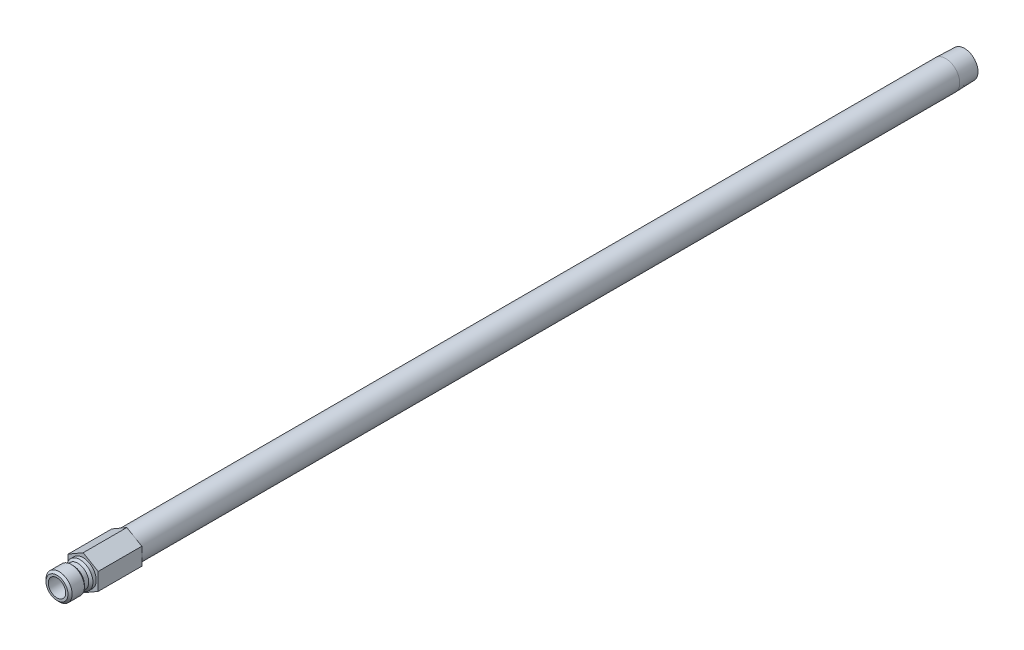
ISO-10303-21;
HEADER;
FILE_DESCRIPTION(('STEP AP214'),'2;1');
FILE_NAME('part.step','',(''),(''),'','','');
FILE_SCHEMA(('AUTOMOTIVE_DESIGN { 1 0 10303 214 1 1 1 1 }'));
ENDSEC;
DATA;
#1=APPLICATION_CONTEXT('core data for automotive mechanical design processes');
#2=APPLICATION_PROTOCOL_DEFINITION('international standard','automotive_design',2000,#1);
#3=PRODUCT_CONTEXT('',#1,'mechanical');
#4=PRODUCT('Part','Part','',(#3));
#5=PRODUCT_RELATED_PRODUCT_CATEGORY('part','',(#4));
#6=PRODUCT_DEFINITION_FORMATION('','',#4);
#7=PRODUCT_DEFINITION_CONTEXT('part definition',#1,'design');
#8=PRODUCT_DEFINITION('design','',#6,#7);
#9=PRODUCT_DEFINITION_SHAPE('','',#8);
#10=(LENGTH_UNIT() NAMED_UNIT(*) SI_UNIT(.MILLI.,.METRE.));
#11=(NAMED_UNIT(*) PLANE_ANGLE_UNIT() SI_UNIT($,.RADIAN.));
#12=(NAMED_UNIT(*) SI_UNIT($,.STERADIAN.) SOLID_ANGLE_UNIT());
#13=UNCERTAINTY_MEASURE_WITH_UNIT(LENGTH_MEASURE(1.E-05),#10,'distance_accuracy_value','');
#14=(GEOMETRIC_REPRESENTATION_CONTEXT(3) GLOBAL_UNCERTAINTY_ASSIGNED_CONTEXT((#13)) GLOBAL_UNIT_ASSIGNED_CONTEXT((#10,
#11,#12)) REPRESENTATION_CONTEXT('',''));
#15=CARTESIAN_POINT('',(0.,0.,0.));
#16=DIRECTION('',(0.,0.,1.));
#17=DIRECTION('',(1.,0.,0.));
#18=AXIS2_PLACEMENT_3D('',#15,#16,#17);
#19=CARTESIAN_POINT('',(0.,4.7625,0.));
#20=DIRECTION('',(0.,0.,1.));
#21=DIRECTION('',(0.,-1.,0.));
#22=AXIS2_PLACEMENT_3D('',#19,#20,#21);
#23=PLANE('',#22);
#24=CARTESIAN_POINT('',(0.,0.,0.));
#25=DIRECTION('',(0.,0.,-1.));
#26=DIRECTION('',(0.,1.,0.));
#27=AXIS2_PLACEMENT_3D('',#24,#25,#26);
#28=CIRCLE('',#27,4.7625);
#29=CARTESIAN_POINT('',(0.,4.7625,0.));
#30=VERTEX_POINT('',#29);
#31=EDGE_CURVE('E166',#30,#30,#28,.T.);
#32=ORIENTED_EDGE('',*,*,#31,.T.);
#33=EDGE_LOOP('',(#32));
#34=FACE_BOUND('',#33,.T.);
#35=DIRECTION('',(-0.866025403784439,-0.5,0.));
#36=VECTOR('',#35,1.);
#37=CARTESIAN_POINT('',(0.,6.3058196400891,0.));
#38=LINE('',#37,#36);
#39=CARTESIAN_POINT('',(0.,6.3058196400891,0.));
#40=VERTEX_POINT('',#39);
#41=CARTESIAN_POINT('',(-5.461,3.15290982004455,0.));
#42=VERTEX_POINT('',#41);
#43=EDGE_CURVE('E122',#40,#42,#38,.T.);
#44=ORIENTED_EDGE('',*,*,#43,.T.);
#45=DIRECTION('',(0.,-1.,0.));
#46=VECTOR('',#45,1.);
#47=CARTESIAN_POINT('',(-5.461,3.15290982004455,0.));
#48=LINE('',#47,#46);
#49=CARTESIAN_POINT('',(-5.461,-3.15290982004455,0.));
#50=VERTEX_POINT('',#49);
#51=EDGE_CURVE('E125',#42,#50,#48,.T.);
#52=ORIENTED_EDGE('',*,*,#51,.T.);
#53=DIRECTION('',(0.866025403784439,-0.5,0.));
#54=VECTOR('',#53,1.);
#55=CARTESIAN_POINT('',(-5.461,-3.15290982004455,0.));
#56=LINE('',#55,#54);
#57=CARTESIAN_POINT('',(0.,-6.30581964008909,0.));
#58=VERTEX_POINT('',#57);
#59=EDGE_CURVE('E129',#50,#58,#56,.T.);
#60=ORIENTED_EDGE('',*,*,#59,.T.);
#61=DIRECTION('',(0.866025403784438,0.5,0.));
#62=VECTOR('',#61,1.);
#63=CARTESIAN_POINT('',(0.,-6.30581964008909,0.));
#64=LINE('',#63,#62);
#65=CARTESIAN_POINT('',(5.461,-3.15290982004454,0.));
#66=VERTEX_POINT('',#65);
#67=EDGE_CURVE('E132',#58,#66,#64,.T.);
#68=ORIENTED_EDGE('',*,*,#67,.T.);
#69=DIRECTION('',(0.,1.,0.));
#70=VECTOR('',#69,1.);
#71=CARTESIAN_POINT('',(5.461,-3.15290982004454,0.));
#72=LINE('',#71,#70);
#73=CARTESIAN_POINT('',(5.461,3.15290982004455,0.));
#74=VERTEX_POINT('',#73);
#75=EDGE_CURVE('E99',#66,#74,#72,.T.);
#76=ORIENTED_EDGE('',*,*,#75,.T.);
#77=DIRECTION('',(-0.866025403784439,0.5,0.));
#78=VECTOR('',#77,1.);
#79=CARTESIAN_POINT('',(5.461,3.15290982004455,0.));
#80=LINE('',#79,#78);
#81=EDGE_CURVE('E135',#74,#40,#80,.T.);
#82=ORIENTED_EDGE('',*,*,#81,.T.);
#83=EDGE_LOOP('',(#44,#52,#60,#68,#76,#82));
#84=FACE_BOUND('',#83,.T.);
#85=ADVANCED_FACE('F33',(#34,#84),#23,.T.);
#86=CARTESIAN_POINT('',(0.,0.,0.));
#87=DIRECTION('',(0.,0.,-1.));
#88=DIRECTION('',(0.,1.,0.));
#89=AXIS2_PLACEMENT_3D('',#86,#87,#88);
#90=CYLINDRICAL_SURFACE('',#89,4.7625);
#91=CARTESIAN_POINT('',(0.,0.,1.2065));
#92=DIRECTION('',(0.,0.,-1.));
#93=DIRECTION('',(0.,1.,0.));
#94=AXIS2_PLACEMENT_3D('',#91,#92,#93);
#95=CIRCLE('',#94,4.7625);
#96=CARTESIAN_POINT('',(0.,4.7625,1.2065));
#97=VERTEX_POINT('',#96);
#98=EDGE_CURVE('E163',#97,#97,#95,.T.);
#99=ORIENTED_EDGE('',*,*,#98,.T.);
#100=EDGE_LOOP('',(#99));
#101=FACE_BOUND('',#100,.T.);
#102=ORIENTED_EDGE('',*,*,#31,.F.);
#103=EDGE_LOOP('',(#102));
#104=FACE_BOUND('',#103,.T.);
#105=ADVANCED_FACE('F192',(#101,#104),#90,.T.);
#106=CARTESIAN_POINT('',(0.,0.,1.2065));
#107=DIRECTION('',(0.,0.,-1.));
#108=DIRECTION('',(0.,1.,0.));
#109=AXIS2_PLACEMENT_3D('',#106,#107,#108);
#110=CONICAL_SURFACE('',#109,4.7625,0.785398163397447);
#111=CARTESIAN_POINT('',(0.,0.,1.9685));
#112=DIRECTION('',(0.,0.,-1.));
#113=DIRECTION('',(0.,1.,0.));
#114=AXIS2_PLACEMENT_3D('',#111,#112,#113);
#115=CIRCLE('',#114,4.0005);
#116=CARTESIAN_POINT('',(0.,4.0005,1.9685));
#117=VERTEX_POINT('',#116);
#118=EDGE_CURVE('E160',#117,#117,#115,.T.);
#119=ORIENTED_EDGE('',*,*,#118,.T.);
#120=EDGE_LOOP('',(#119));
#121=FACE_BOUND('',#120,.T.);
#122=ORIENTED_EDGE('',*,*,#98,.F.);
#123=EDGE_LOOP('',(#122));
#124=FACE_BOUND('',#123,.T.);
#125=ADVANCED_FACE('F198',(#121,#124),#110,.T.);
#126=CARTESIAN_POINT('',(0.,0.,0.));
#127=DIRECTION('',(0.,0.,-1.));
#128=DIRECTION('',(0.,1.,0.));
#129=AXIS2_PLACEMENT_3D('',#126,#127,#128);
#130=CYLINDRICAL_SURFACE('',#129,4.0005);
#131=CARTESIAN_POINT('',(0.,0.,3.556));
#132=DIRECTION('',(0.,0.,-1.));
#133=DIRECTION('',(0.,1.,0.));
#134=AXIS2_PLACEMENT_3D('',#131,#132,#133);
#135=CIRCLE('',#134,4.0005);
#136=CARTESIAN_POINT('',(0.,4.0005,3.556));
#137=VERTEX_POINT('',#136);
#138=EDGE_CURVE('E157',#137,#137,#135,.T.);
#139=ORIENTED_EDGE('',*,*,#138,.T.);
#140=EDGE_LOOP('',(#139));
#141=FACE_BOUND('',#140,.T.);
#142=ORIENTED_EDGE('',*,*,#118,.F.);
#143=EDGE_LOOP('',(#142));
#144=FACE_BOUND('',#143,.T.);
#145=ADVANCED_FACE('F258',(#141,#144),#130,.T.);
#146=CARTESIAN_POINT('',(0.,0.,3.556));
#147=DIRECTION('',(0.,0.,1.));
#148=DIRECTION('',(0.,-1.,0.));
#149=AXIS2_PLACEMENT_3D('',#146,#147,#148);
#150=CONICAL_SURFACE('',#149,4.0005,0.785398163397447);
#151=CARTESIAN_POINT('',(0.,0.,4.318));
#152=DIRECTION('',(0.,0.,-1.));
#153=DIRECTION('',(0.,1.,0.));
#154=AXIS2_PLACEMENT_3D('',#151,#152,#153);
#155=CIRCLE('',#154,4.7625);
#156=CARTESIAN_POINT('',(0.,4.7625,4.318));
#157=VERTEX_POINT('',#156);
#158=EDGE_CURVE('E154',#157,#157,#155,.T.);
#159=ORIENTED_EDGE('',*,*,#158,.T.);
#160=EDGE_LOOP('',(#159));
#161=FACE_BOUND('',#160,.T.);
#162=ORIENTED_EDGE('',*,*,#138,.F.);
#163=EDGE_LOOP('',(#162));
#164=FACE_BOUND('',#163,.T.);
#165=ADVANCED_FACE('F254',(#161,#164),#150,.T.);
#166=CARTESIAN_POINT('',(0.,0.,0.));
#167=DIRECTION('',(0.,0.,-1.));
#168=DIRECTION('',(0.,1.,0.));
#169=AXIS2_PLACEMENT_3D('',#166,#167,#168);
#170=CYLINDRICAL_SURFACE('',#169,4.7625);
#171=CARTESIAN_POINT('',(0.,0.,8.763));
#172=DIRECTION('',(0.,0.,-1.));
#173=DIRECTION('',(0.,1.,0.));
#174=AXIS2_PLACEMENT_3D('',#171,#172,#173);
#175=CIRCLE('',#174,4.7625);
#176=CARTESIAN_POINT('',(0.,4.7625,8.763));
#177=VERTEX_POINT('',#176);
#178=EDGE_CURVE('E151',#177,#177,#175,.T.);
#179=ORIENTED_EDGE('',*,*,#178,.T.);
#180=EDGE_LOOP('',(#179));
#181=FACE_BOUND('',#180,.T.);
#182=ORIENTED_EDGE('',*,*,#158,.F.);
#183=EDGE_LOOP('',(#182));
#184=FACE_BOUND('',#183,.T.);
#185=ADVANCED_FACE('F250',(#181,#184),#170,.T.);
#186=CARTESIAN_POINT('',(0.,0.,8.763));
#187=DIRECTION('',(0.,0.,-1.));
#188=DIRECTION('',(0.,1.,0.));
#189=AXIS2_PLACEMENT_3D('',#186,#187,#188);
#190=CONICAL_SURFACE('',#189,4.7625,0.785398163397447);
#191=CARTESIAN_POINT('',(0.,0.,9.525));
#192=DIRECTION('',(0.,0.,-1.));
#193=DIRECTION('',(0.,1.,0.));
#194=AXIS2_PLACEMENT_3D('',#191,#192,#193);
#195=CIRCLE('',#194,4.0005);
#196=CARTESIAN_POINT('',(0.,4.0005,9.525));
#197=VERTEX_POINT('',#196);
#198=EDGE_CURVE('E148',#197,#197,#195,.T.);
#199=ORIENTED_EDGE('',*,*,#198,.T.);
#200=EDGE_LOOP('',(#199));
#201=FACE_BOUND('',#200,.T.);
#202=ORIENTED_EDGE('',*,*,#178,.F.);
#203=EDGE_LOOP('',(#202));
#204=FACE_BOUND('',#203,.T.);
#205=ADVANCED_FACE('F246',(#201,#204),#190,.T.);
#206=CARTESIAN_POINT('',(0.,3.175,9.525));
#207=DIRECTION('',(0.,0.,1.));
#208=DIRECTION('',(0.,-1.,0.));
#209=AXIS2_PLACEMENT_3D('',#206,#207,#208);
#210=PLANE('',#209);
#211=CARTESIAN_POINT('',(0.,0.,9.525));
#212=DIRECTION('',(0.,0.,-1.));
#213=DIRECTION('',(0.,1.,0.));
#214=AXIS2_PLACEMENT_3D('',#211,#212,#213);
#215=CIRCLE('',#214,3.175);
#216=CARTESIAN_POINT('',(0.,3.175,9.525));
#217=VERTEX_POINT('',#216);
#218=EDGE_CURVE('E145',#217,#217,#215,.T.);
#219=ORIENTED_EDGE('',*,*,#218,.T.);
#220=EDGE_LOOP('',(#219));
#221=FACE_BOUND('',#220,.T.);
#222=ORIENTED_EDGE('',*,*,#198,.F.);
#223=EDGE_LOOP('',(#222));
#224=FACE_BOUND('',#223,.T.);
#225=ADVANCED_FACE('F242',(#221,#224),#210,.T.);
#226=CARTESIAN_POINT('',(0.,0.,0.));
#227=DIRECTION('',(0.,0.,-1.));
#228=DIRECTION('',(0.,1.,0.));
#229=AXIS2_PLACEMENT_3D('',#226,#227,#228);
#230=CYLINDRICAL_SURFACE('',#229,3.175);
#231=CARTESIAN_POINT('',(0.,0.,0.));
#232=DIRECTION('',(0.,0.,1.));
#233=DIRECTION('',(1.,0.,0.));
#234=AXIS2_PLACEMENT_3D('',#231,#232,#233);
#235=CIRCLE('',#234,3.175);
#236=CARTESIAN_POINT('',(3.175,0.,0.));
#237=VERTEX_POINT('',#236);
#238=EDGE_CURVE('E11',#237,#237,#235,.T.);
#239=ORIENTED_EDGE('',*,*,#238,.F.);
#240=EDGE_LOOP('',(#239));
#241=FACE_BOUND('',#240,.T.);
#242=ORIENTED_EDGE('',*,*,#218,.F.);
#243=EDGE_LOOP('',(#242));
#244=FACE_BOUND('',#243,.T.);
#245=ADVANCED_FACE('F226',(#241,#244),#230,.F.);
#246=CARTESIAN_POINT('',(-5.461,3.15290982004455,0.));
#247=DIRECTION('',(0.,0.,1.));
#248=DIRECTION('',(1.,0.,0.));
#249=AXIS2_PLACEMENT_3D('',#246,#247,#248);
#250=PLANE('',#249);
#251=ORIENTED_EDGE('',*,*,#238,.T.);
#252=EDGE_LOOP('',(#251));
#253=FACE_BOUND('',#252,.T.);
#254=CARTESIAN_POINT('',(0.,0.,0.));
#255=DIRECTION('',(0.,0.,1.));
#256=DIRECTION('',(1.,0.,0.));
#257=AXIS2_PLACEMENT_3D('',#254,#255,#256);
#258=CIRCLE('',#257,2.38124999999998);
#259=CARTESIAN_POINT('',(2.38124999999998,0.,0.));
#260=VERTEX_POINT('',#259);
#261=EDGE_CURVE('E126',#260,#260,#258,.T.);
#262=ORIENTED_EDGE('',*,*,#261,.F.);
#263=EDGE_LOOP('',(#262));
#264=FACE_BOUND('',#263,.T.);
#265=ADVANCED_FACE('F222',(#253,#264),#250,.T.);
#266=CARTESIAN_POINT('',(0.,6.3058196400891,-15.875));
#267=DIRECTION('',(-0.5,0.866025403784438,0.));
#268=DIRECTION('',(-0.866025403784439,-0.5,0.));
#269=AXIS2_PLACEMENT_3D('',#266,#267,#268);
#270=PLANE('',#269);
#271=ORIENTED_EDGE('',*,*,#43,.F.);
#272=DIRECTION('',(0.,0.,1.));
#273=VECTOR('',#272,1.);
#274=CARTESIAN_POINT('',(0.,6.3058196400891,-15.875));
#275=LINE('',#274,#273);
#276=CARTESIAN_POINT('',(0.,6.3058196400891,-15.875));
#277=VERTEX_POINT('',#276);
#278=EDGE_CURVE('E51',#277,#40,#275,.T.);
#279=ORIENTED_EDGE('',*,*,#278,.F.);
#280=DIRECTION('',(-0.866025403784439,-0.5,0.));
#281=VECTOR('',#280,1.);
#282=CARTESIAN_POINT('',(0.,6.3058196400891,-15.875));
#283=LINE('',#282,#281);
#284=CARTESIAN_POINT('',(-5.461,3.15290982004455,-15.875));
#285=VERTEX_POINT('',#284);
#286=EDGE_CURVE('E138',#277,#285,#283,.T.);
#287=ORIENTED_EDGE('',*,*,#286,.T.);
#288=DIRECTION('',(0.,0.,1.));
#289=VECTOR('',#288,1.);
#290=CARTESIAN_POINT('',(-5.461,3.15290982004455,-15.875));
#291=LINE('',#290,#289);
#292=EDGE_CURVE('E86',#285,#42,#291,.T.);
#293=ORIENTED_EDGE('',*,*,#292,.T.);
#294=EDGE_LOOP('',(#271,#279,#287,#293));
#295=FACE_BOUND('',#294,.T.);
#296=ADVANCED_FACE('F225',(#295),#270,.T.);
#297=CARTESIAN_POINT('',(5.461,3.15290982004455,-15.875));
#298=DIRECTION('',(0.5,0.866025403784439,0.));
#299=DIRECTION('',(-0.866025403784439,0.5,0.));
#300=AXIS2_PLACEMENT_3D('',#297,#298,#299);
#301=PLANE('',#300);
#302=ORIENTED_EDGE('',*,*,#81,.F.);
#303=DIRECTION('',(0.,0.,1.));
#304=VECTOR('',#303,1.);
#305=CARTESIAN_POINT('',(5.461,3.15290982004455,-15.875));
#306=LINE('',#305,#304);
#307=CARTESIAN_POINT('',(5.461,3.15290982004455,-15.875));
#308=VERTEX_POINT('',#307);
#309=EDGE_CURVE('E74',#308,#74,#306,.T.);
#310=ORIENTED_EDGE('',*,*,#309,.F.);
#311=DIRECTION('',(-0.866025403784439,0.5,0.));
#312=VECTOR('',#311,1.);
#313=CARTESIAN_POINT('',(5.461,3.15290982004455,-15.875));
#314=LINE('',#313,#312);
#315=EDGE_CURVE('E112',#308,#277,#314,.T.);
#316=ORIENTED_EDGE('',*,*,#315,.T.);
#317=ORIENTED_EDGE('',*,*,#278,.T.);
#318=EDGE_LOOP('',(#302,#310,#316,#317));
#319=FACE_BOUND('',#318,.T.);
#320=ADVANCED_FACE('F228',(#319),#301,.T.);
#321=CARTESIAN_POINT('',(5.461,-3.15290982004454,-15.875));
#322=DIRECTION('',(1.,0.,0.));
#323=DIRECTION('',(0.,1.,0.));
#324=AXIS2_PLACEMENT_3D('',#321,#322,#323);
#325=PLANE('',#324);
#326=ORIENTED_EDGE('',*,*,#75,.F.);
#327=DIRECTION('',(0.,0.,1.));
#328=VECTOR('',#327,1.);
#329=CARTESIAN_POINT('',(5.461,-3.15290982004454,-15.875));
#330=LINE('',#329,#328);
#331=CARTESIAN_POINT('',(5.461,-3.15290982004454,-15.875));
#332=VERTEX_POINT('',#331);
#333=EDGE_CURVE('E94',#332,#66,#330,.T.);
#334=ORIENTED_EDGE('',*,*,#333,.F.);
#335=DIRECTION('',(0.,1.,0.));
#336=VECTOR('',#335,1.);
#337=CARTESIAN_POINT('',(5.461,-3.15290982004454,-15.875));
#338=LINE('',#337,#336);
#339=EDGE_CURVE('E97',#332,#308,#338,.T.);
#340=ORIENTED_EDGE('',*,*,#339,.T.);
#341=ORIENTED_EDGE('',*,*,#309,.T.);
#342=EDGE_LOOP('',(#326,#334,#340,#341));
#343=FACE_BOUND('',#342,.T.);
#344=ADVANCED_FACE('F96',(#343),#325,.T.);
#345=CARTESIAN_POINT('',(0.,-6.30581964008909,-15.875));
#346=DIRECTION('',(0.5,-0.866025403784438,0.));
#347=DIRECTION('',(0.866025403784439,0.5,0.));
#348=AXIS2_PLACEMENT_3D('',#345,#346,#347);
#349=PLANE('',#348);
#350=ORIENTED_EDGE('',*,*,#67,.F.);
#351=DIRECTION('',(0.,0.,1.));
#352=VECTOR('',#351,1.);
#353=CARTESIAN_POINT('',(0.,-6.30581964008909,-15.875));
#354=LINE('',#353,#352);
#355=CARTESIAN_POINT('',(0.,-6.30581964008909,-15.875));
#356=VERTEX_POINT('',#355);
#357=EDGE_CURVE('E104',#356,#58,#354,.T.);
#358=ORIENTED_EDGE('',*,*,#357,.F.);
#359=DIRECTION('',(0.866025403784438,0.5,0.));
#360=VECTOR('',#359,1.);
#361=CARTESIAN_POINT('',(0.,-6.30581964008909,-15.875));
#362=LINE('',#361,#360);
#363=EDGE_CURVE('E110',#356,#332,#362,.T.);
#364=ORIENTED_EDGE('',*,*,#363,.T.);
#365=ORIENTED_EDGE('',*,*,#333,.T.);
#366=EDGE_LOOP('',(#350,#358,#364,#365));
#367=FACE_BOUND('',#366,.T.);
#368=ADVANCED_FACE('F114',(#367),#349,.T.);
#369=CARTESIAN_POINT('',(-5.461,-3.15290982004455,-15.875));
#370=DIRECTION('',(-0.5,-0.866025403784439,0.));
#371=DIRECTION('',(0.866025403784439,-0.5,0.));
#372=AXIS2_PLACEMENT_3D('',#369,#370,#371);
#373=PLANE('',#372);
#374=ORIENTED_EDGE('',*,*,#59,.F.);
#375=DIRECTION('',(0.,0.,1.));
#376=VECTOR('',#375,1.);
#377=CARTESIAN_POINT('',(-5.461,-3.15290982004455,-15.875));
#378=LINE('',#377,#376);
#379=CARTESIAN_POINT('',(-5.461,-3.15290982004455,-15.875));
#380=VERTEX_POINT('',#379);
#381=EDGE_CURVE('E142',#380,#50,#378,.T.);
#382=ORIENTED_EDGE('',*,*,#381,.F.);
#383=DIRECTION('',(0.866025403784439,-0.5,0.));
#384=VECTOR('',#383,1.);
#385=CARTESIAN_POINT('',(-5.461,-3.15290982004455,-15.875));
#386=LINE('',#385,#384);
#387=EDGE_CURVE('E115',#380,#356,#386,.T.);
#388=ORIENTED_EDGE('',*,*,#387,.T.);
#389=ORIENTED_EDGE('',*,*,#357,.T.);
#390=EDGE_LOOP('',(#374,#382,#388,#389));
#391=FACE_BOUND('',#390,.T.);
#392=ADVANCED_FACE('F219',(#391),#373,.T.);
#393=CARTESIAN_POINT('',(-5.461,3.15290982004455,-15.875));
#394=DIRECTION('',(-1.,0.,0.));
#395=DIRECTION('',(0.,0.,1.));
#396=AXIS2_PLACEMENT_3D('',#393,#394,#395);
#397=PLANE('',#396);
#398=ORIENTED_EDGE('',*,*,#51,.F.);
#399=ORIENTED_EDGE('',*,*,#292,.F.);
#400=DIRECTION('',(0.,-1.,0.));
#401=VECTOR('',#400,1.);
#402=CARTESIAN_POINT('',(-5.461,3.15290982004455,-15.875));
#403=LINE('',#402,#401);
#404=EDGE_CURVE('E117',#285,#380,#403,.T.);
#405=ORIENTED_EDGE('',*,*,#404,.T.);
#406=ORIENTED_EDGE('',*,*,#381,.T.);
#407=EDGE_LOOP('',(#398,#399,#405,#406));
#408=FACE_BOUND('',#407,.T.);
#409=ADVANCED_FACE('F214',(#408),#397,.T.);
#410=CARTESIAN_POINT('',(-5.461,3.15290982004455,-15.875));
#411=DIRECTION('',(0.,0.,1.));
#412=DIRECTION('',(1.,0.,0.));
#413=AXIS2_PLACEMENT_3D('',#410,#411,#412);
#414=PLANE('',#413);
#415=CARTESIAN_POINT('',(0.,0.,-15.875));
#416=DIRECTION('',(0.,0.,1.));
#417=DIRECTION('',(1.,0.,0.));
#418=AXIS2_PLACEMENT_3D('',#415,#416,#417);
#419=CIRCLE('',#418,5.14349999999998);
#420=CARTESIAN_POINT('',(5.14349999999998,0.,-15.875));
#421=VERTEX_POINT('',#420);
#422=EDGE_CURVE('E37',#421,#421,#419,.F.);
#423=ORIENTED_EDGE('',*,*,#422,.F.);
#424=EDGE_LOOP('',(#423));
#425=FACE_BOUND('',#424,.T.);
#426=ORIENTED_EDGE('',*,*,#286,.F.);
#427=ORIENTED_EDGE('',*,*,#315,.F.);
#428=ORIENTED_EDGE('',*,*,#339,.F.);
#429=ORIENTED_EDGE('',*,*,#363,.F.);
#430=ORIENTED_EDGE('',*,*,#387,.F.);
#431=ORIENTED_EDGE('',*,*,#404,.F.);
#432=EDGE_LOOP('',(#426,#427,#428,#429,#430,#431));
#433=FACE_BOUND('',#432,.T.);
#434=ADVANCED_FACE('F108',(#425,#433),#414,.F.);
#435=CARTESIAN_POINT('',(0.,0.,0.));
#436=DIRECTION('',(0.,0.,-1.));
#437=DIRECTION('',(0.,1.,0.));
#438=AXIS2_PLACEMENT_3D('',#435,#436,#437);
#439=CYLINDRICAL_SURFACE('',#438,2.38124999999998);
#440=CARTESIAN_POINT('',(0.,0.,-320.675));
#441=DIRECTION('',(0.,0.,-1.));
#442=DIRECTION('',(0.,1.,0.));
#443=AXIS2_PLACEMENT_3D('',#440,#441,#442);
#444=CIRCLE('',#443,2.38124999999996);
#445=CARTESIAN_POINT('',(0.,2.38125,-320.675));
#446=VERTEX_POINT('',#445);
#447=EDGE_CURVE('E43',#446,#446,#444,.T.);
#448=ORIENTED_EDGE('',*,*,#447,.T.);
#449=EDGE_LOOP('',(#448));
#450=FACE_BOUND('',#449,.T.);
#451=ORIENTED_EDGE('',*,*,#261,.T.);
#452=EDGE_LOOP('',(#451));
#453=FACE_BOUND('',#452,.T.);
#454=ADVANCED_FACE('F35',(#450,#453),#439,.F.);
#455=CARTESIAN_POINT('',(0.,4.9291887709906,-320.675));
#456=DIRECTION('',(0.,0.,-1.));
#457=DIRECTION('',(0.,1.,0.));
#458=AXIS2_PLACEMENT_3D('',#455,#456,#457);
#459=PLANE('',#458);
#460=CARTESIAN_POINT('',(0.,0.,-320.675));
#461=DIRECTION('',(0.,0.,-1.));
#462=DIRECTION('',(0.,1.,0.));
#463=AXIS2_PLACEMENT_3D('',#460,#461,#462);
#464=CIRCLE('',#463,4.92918877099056);
#465=CARTESIAN_POINT('',(0.,4.9291887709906,-320.675));
#466=VERTEX_POINT('',#465);
#467=EDGE_CURVE('E172',#466,#466,#464,.T.);
#468=ORIENTED_EDGE('',*,*,#467,.T.);
#469=EDGE_LOOP('',(#468));
#470=FACE_BOUND('',#469,.T.);
#471=ORIENTED_EDGE('',*,*,#447,.F.);
#472=EDGE_LOOP('',(#471));
#473=FACE_BOUND('',#472,.T.);
#474=ADVANCED_FACE('F180',(#470,#473),#459,.T.);
#475=CARTESIAN_POINT('',(0.,0.,-320.675));
#476=DIRECTION('',(0.,0.,1.));
#477=DIRECTION('',(0.,-1.,0.));
#478=AXIS2_PLACEMENT_3D('',#475,#476,#477);
#479=CONICAL_SURFACE('',#478,4.92918877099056,0.0312396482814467);
#480=CARTESIAN_POINT('',(0.,0.,-313.817));
#481=DIRECTION('',(0.,0.,-1.));
#482=DIRECTION('',(0.,1.,0.));
#483=AXIS2_PLACEMENT_3D('',#480,#481,#482);
#484=CIRCLE('',#483,5.14349999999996);
#485=CARTESIAN_POINT('',(0.,5.1435,-313.817));
#486=VERTEX_POINT('',#485);
#487=EDGE_CURVE('E169',#486,#486,#484,.T.);
#488=ORIENTED_EDGE('',*,*,#487,.T.);
#489=EDGE_LOOP('',(#488));
#490=FACE_BOUND('',#489,.T.);
#491=ORIENTED_EDGE('',*,*,#467,.F.);
#492=EDGE_LOOP('',(#491));
#493=FACE_BOUND('',#492,.T.);
#494=ADVANCED_FACE('F182',(#490,#493),#479,.T.);
#495=CARTESIAN_POINT('',(0.,0.,0.));
#496=DIRECTION('',(0.,0.,-1.));
#497=DIRECTION('',(0.,1.,0.));
#498=AXIS2_PLACEMENT_3D('',#495,#496,#497);
#499=CYLINDRICAL_SURFACE('',#498,5.14349999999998);
#500=ORIENTED_EDGE('',*,*,#487,.F.);
#501=EDGE_LOOP('',(#500));
#502=FACE_BOUND('',#501,.T.);
#503=ORIENTED_EDGE('',*,*,#422,.T.);
#504=EDGE_LOOP('',(#503));
#505=FACE_BOUND('',#504,.T.);
#506=ADVANCED_FACE('F188',(#502,#505),#499,.T.);
#507=CLOSED_SHELL('',(#85,#105,#125,#145,#165,#185,#205,#225,#245,#265,#296,#320,#344,#368,#392,
#409,#434,#454,#474,#494,#506));
#508=MANIFOLD_SOLID_BREP('B2',#507);
#509=ADVANCED_BREP_SHAPE_REPRESENTATION('',(#18,#508),#14);
#510=SHAPE_DEFINITION_REPRESENTATION(#9,#509);
ENDSEC;
END-ISO-10303-21;
